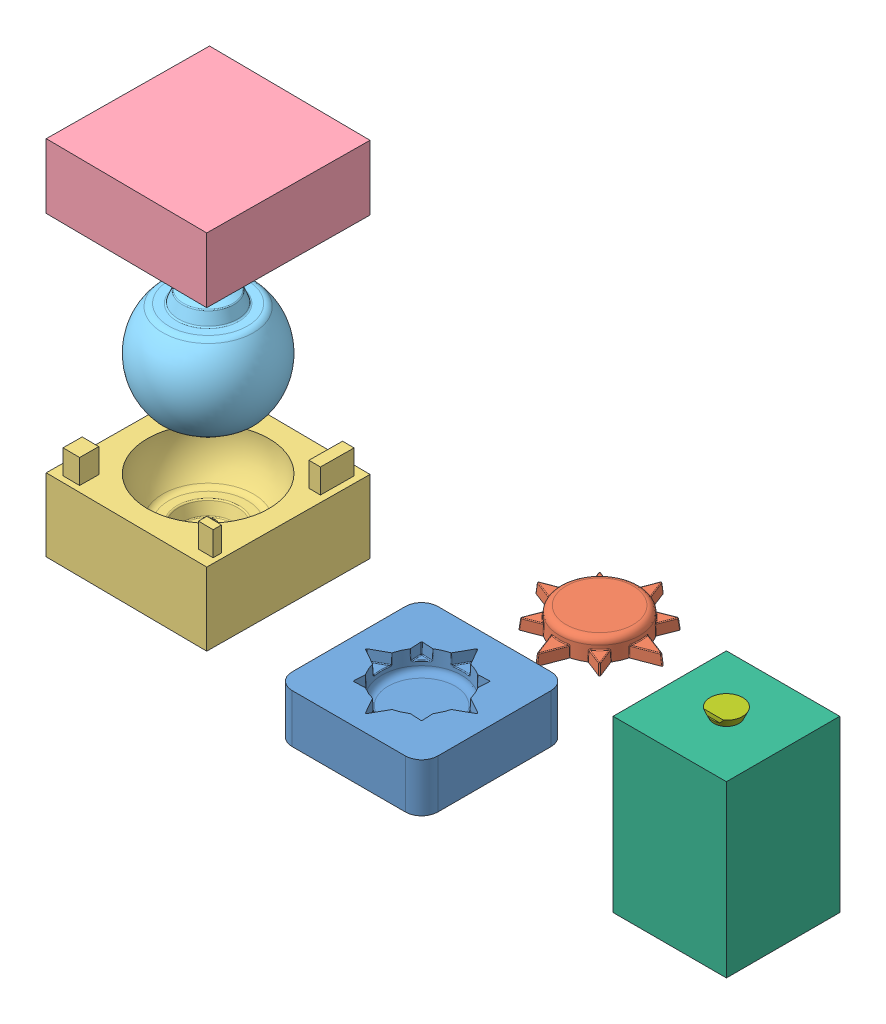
SolidWorks assembly MoldTypes.SLDASM, configuration Default (file format 11000). Lengths in mm.
Overall size (433.83 225.18 192.37).
8 component instances, 7 part files, 5 mates.
Components (placement in the parent):
- SunMold-1: SunMold.SLDPRT [Default] at (-228.1411 30 30.1757) x (1 0 0) z (0 0 -1) size (90 30 90)
- Sun-1: Sun.SLDPRT [Default] at (-226.4846 4.2802 -78.0927) size (78.2 13 78.2)
- BivalveMold-1: BivalveMold.SLDASM [Default] at (-390.1133 45 0.0734) x (-0.999962 0 -0.008727) z (0.008727 0 -0.999962) size (100 223.72 100)
  - BivalveB-1: BivalveB.SLDPRT [Default] at origin size (100 60 100)
  - BivalveA-1: BivalveA.SLDPRT [Default] at (0 138.7193 0) size (100 40 100)
  - BivalveSphere-1: BivalveSphere.SLDPRT [Default] at (0 64.4617 0) x (-0.985266 0 -0.171032) z (0.171032 0 -0.985266) size (75 72.89 75)
- Destructive-1: Destructive.SLDPRT [Default] at (-41.7131 8.5351 28.3485) size (70 105 70)
- Destroy-1: Destroy.SLDPRT [Default] at (-41.7131 8.5351 28.3485) size (45.34 100 45.34)
Mates (geometry in assembly coordinates):
- Coincident1: coincident: plane of SunMold-1 through (-228.1411 0 30.1757) normal (0 -1 0); plane of assembly through (0 0 0) normal (0 1 0)
- Concentric1: concentric: circle of Destructive-1; circle of Destroy-1
- Coincident3: coincident: plane of BivalveMold-1/BivalveB-1 through (-390.1133 0 0.0734) normal (0 -1 0); plane of assembly through (0 0 0) normal (0 1 0)
- Parallel1: parallel: plane of Destructive-1 through (-76.7131 103.5351 63.3485) normal (0 0 1); plane of Destroy-1 through (-41.7131 16.2351 36.3485) normal (0 0 1)
- Distance1: distance = 5 mm: plane of Destroy-1 through (-41.7131 108.5351 28.3485) normal (0 1 0); plane of Destructive-1 through (-41.7131 103.5351 28.3485) normal (0 1 0)
